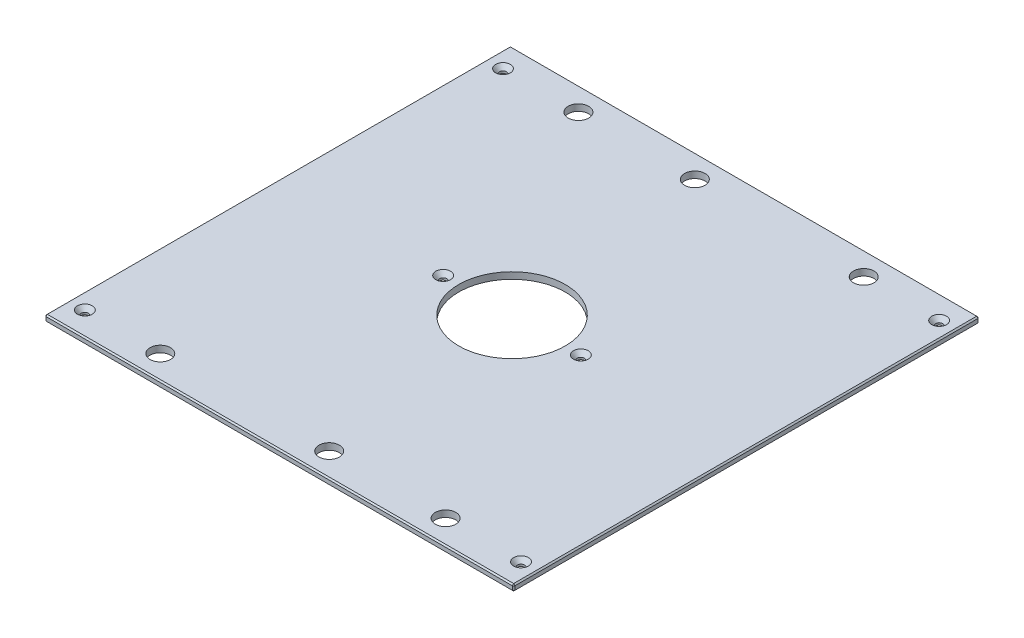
from build123d import *

# Parameters (mm, degrees)
SKETCH1_W                                     = 454.025
SKETCH1_H                                     = 450.85
BOSS_EXTRUDE1_DEPTH                           = 6.35
SKETCH13_R                                    = 51.562
CUT_EXTRUDE6_DEPTH                            = 320.986606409
F_25_32_0_78125_DIAMETER_HOLE1_D              = 19.84375
CHAMFER2_SIZE                                 = 1.27
CSK_FOR_1_4_FLAT_HEAD_MACHINE_SCREW1_AT_COUNT = 2
CSK_FOR_1_4_FLAT_HEAD_MACHINE_SCREW1_AT_PITCH = 404.80996
CSK_FOR_1_4_FLAT_HEAD_MACHINE_SCREW1_2_COUNT  = 2
CSK_FOR_1_4_FLAT_HEAD_MACHINE_SCREW1_2_PITCH  = 584.967759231
CSK_FOR_1_4_FLAT_HEAD_MACHINE_SCREW1_3_COUNT  = 2
CSK_FOR_1_4_FLAT_HEAD_MACHINE_SCREW1_3_PITCH  = 343.725997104
CSK_FOR_1_4_FLAT_HEAD_MACHINE_SCREW1_4_COUNT  = 2
CSK_FOR_1_4_FLAT_HEAD_MACHINE_SCREW1_4_PITCH  = 248.670846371
CSK_FOR_1_4_FLAT_HEAD_MACHINE_SCREW1_5_COUNT  = 2
CSK_FOR_1_4_FLAT_HEAD_MACHINE_SCREW1_5_PITCH  = 422.275
CSK_FOR_1_4_FLAT_HEAD_MACHINE_SCREW1_6_COUNT  = 2
CSK_FOR_1_4_FLAT_HEAD_MACHINE_SCREW1_6_PITCH  = 349.25
CSK_FOR_1_4_FLAT_HEAD_MACHINE_SCREW1_7_COUNT  = 2
CSK_FOR_1_4_FLAT_HEAD_MACHINE_SCREW1_7_PITCH  = 534.646300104


with BuildPart() as part:
    # Sketch1 → Boss-Extrude1 (new body)
    with BuildSketch(Plane(origin=(0, 0, 0), x_dir=(1, 0, 0), z_dir=(0, 1, 0))):
        Rectangle(SKETCH1_W, SKETCH1_H)
    extrude(amount=BOSS_EXTRUDE1_DEPTH)

    # Sketch13 → Cut-Extrude6 (cut, through all)
    with BuildSketch(Plane(origin=(0, 6.35, 0), x_dir=(1, 0, 0), z_dir=(0, 1, 0))):
        with Locations(Location((0, 0, 0), (0, 0, 270))):
            Circle(SKETCH13_R)
    extrude(amount=-CUT_EXTRUDE6_DEPTH, mode=Mode.SUBTRACT)

    # 25_32 _0.78125_ Diameter Hole1 (through all)
    with Locations(Plane(origin=(0, 6.35, 0), x_dir=(1, 0, 0), z_dir=(0, 1, 0))):
        with Locations((138.1125, 202.40498), (-138.1125, 202.40498), (138.1125, -202.40498), (-138.1125, -202.40498), (-25.4, 202.40498), (25.4, -202.40498)):
            Hole(F_25_32_0_78125_DIAMETER_HOLE1_D / 2)

    # Chamfer2
    chamfer2_edges = [part.edges().sort_by_distance(p)[0] for p in [
        (227.0125, 6.35, 0),
        (0, 6.35, -225.425),
        (-227.0125, 6.35, 0),
        (0, 0, -225.425),
        (227.0125, 0, 0),
        (0, 0, 225.425),
        (-227.0125, 0, 0),
        (0, 6.35, 225.425),
        (-227.0125, 3.175, -225.425),
        (227.0125, 3.175, -225.425),
        (227.0125, 3.175, 225.425),
        (-227.0125, 3.175, 225.425),
    ]]
    chamfer(chamfer2_edges, length=CHAMFER2_SIZE)

    # Sketch24 → CSK for 1_4 Flat Head Machine Screw1 (revolve, cut)
    with BuildSketch(Plane(origin=(211.1375, 6.35, -202.40498), x_dir=(0, 0, 1), z_dir=(1, 0, 0))):
        Polygon((0, 0), (0, 6.35), (3.3782, 6.35), (3.3782, 4.324464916), (7.1374, 0), align=None)
    csk_for_1_4_flat_head_machine_screw1 = revolve(axis=Axis((211.1375, 12.7, -202.40498), (0, -1, 0)), mode=Mode.SUBTRACT)

    # CSK for 1_4 Flat Head Machine Screw1 at: CSK for 1_4 Flat Head Machine Screw1 ×2
    with Locations(*[(0, 0, i * CSK_FOR_1_4_FLAT_HEAD_MACHINE_SCREW1_AT_PITCH) for i in range(1, CSK_FOR_1_4_FLAT_HEAD_MACHINE_SCREW1_AT_COUNT)]):
        add(csk_for_1_4_flat_head_machine_screw1, mode=Mode.SUBTRACT)

    # CSK for 1_4 Flat Head Machine Screw1 2: CSK for 1_4 Flat Head Machine Screw1 ×2
    with Locations(*[Vector(-0.7218773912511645, 0, 0.6920209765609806) * (i * CSK_FOR_1_4_FLAT_HEAD_MACHINE_SCREW1_2_PITCH) for i in range(1, CSK_FOR_1_4_FLAT_HEAD_MACHINE_SCREW1_2_COUNT)]):
        add(csk_for_1_4_flat_head_machine_screw1, mode=Mode.SUBTRACT)

    # CSK for 1_4 Flat Head Machine Screw1 3: CSK for 1_4 Flat Head Machine Screw1 ×2
    with Locations(*[Vector(-0.8082382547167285, 0, 0.5888556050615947) * (i * CSK_FOR_1_4_FLAT_HEAD_MACHINE_SCREW1_3_PITCH) for i in range(1, CSK_FOR_1_4_FLAT_HEAD_MACHINE_SCREW1_3_COUNT)]):
        add(csk_for_1_4_flat_head_machine_screw1, mode=Mode.SUBTRACT)

    # CSK for 1_4 Flat Head Machine Screw1 4: CSK for 1_4 Flat Head Machine Screw1 ×2
    with Locations(*[Vector(-0.5809386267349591, 0, 0.813947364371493) * (i * CSK_FOR_1_4_FLAT_HEAD_MACHINE_SCREW1_4_PITCH) for i in range(1, CSK_FOR_1_4_FLAT_HEAD_MACHINE_SCREW1_4_COUNT)]):
        add(csk_for_1_4_flat_head_machine_screw1, mode=Mode.SUBTRACT)

    # CSK for 1_4 Flat Head Machine Screw1 5: CSK for 1_4 Flat Head Machine Screw1 ×2
    with Locations(*[(-i * CSK_FOR_1_4_FLAT_HEAD_MACHINE_SCREW1_5_PITCH, 0, 0) for i in range(1, CSK_FOR_1_4_FLAT_HEAD_MACHINE_SCREW1_5_COUNT)]):
        add(csk_for_1_4_flat_head_machine_screw1, mode=Mode.SUBTRACT)

    # CSK for 1_4 Flat Head Machine Screw1 6: CSK for 1_4 Flat Head Machine Screw1 ×2
    with Locations(*[(-i * CSK_FOR_1_4_FLAT_HEAD_MACHINE_SCREW1_6_PITCH, 0, 0) for i in range(1, CSK_FOR_1_4_FLAT_HEAD_MACHINE_SCREW1_6_COUNT)]):
        add(csk_for_1_4_flat_head_machine_screw1, mode=Mode.SUBTRACT)

    # CSK for 1_4 Flat Head Machine Screw1 7: CSK for 1_4 Flat Head Machine Screw1 ×2
    with Locations(*[Vector(-0.6532356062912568, 0, 0.7571547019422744) * (i * CSK_FOR_1_4_FLAT_HEAD_MACHINE_SCREW1_7_PITCH) for i in range(1, CSK_FOR_1_4_FLAT_HEAD_MACHINE_SCREW1_7_COUNT)]):
        add(csk_for_1_4_flat_head_machine_screw1, mode=Mode.SUBTRACT)


solid = part.part
